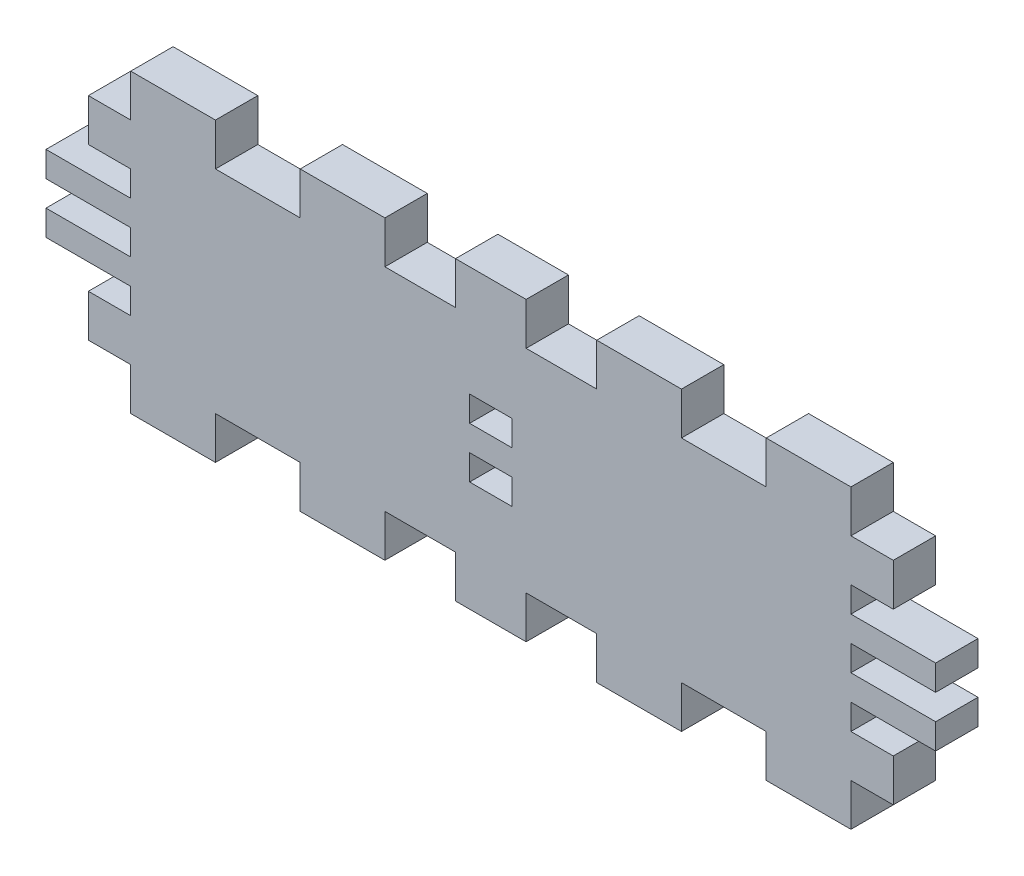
from build123d import *

# Parameters (mm, degrees)
SKETCH1_W           = 63
SKETCH1_H           = 21
BOSS_EXTRUDE1_DEPTH = 3
SKETCH2_W           = 3
SKETCH2_H           = 1.8
CUT_EXTRUDE1_DEPTH  = 10
SKETCH3_W           = 6
SKETCH3_H           = 1.8
CUT_EXTRUDE2_DEPTH  = 10
SKETCH4_W           = 6
SKETCH4_H           = 3
SKETCH4_W_2         = 5
CUT_EXTRUDE7_DEPTH  = 10


with BuildPart() as part:
    # Sketch1 → Boss-Extrude1 (new body)
    with BuildSketch(Plane.XY):
        Rectangle(SKETCH1_W, SKETCH1_H)
    extrude(amount=BOSS_EXTRUDE1_DEPTH)

    # Sketch2 → Cut-Extrude1 (cut)
    with BuildSketch(Plane(origin=(0, 0, 0), x_dir=(-1, 0, 0), z_dir=(0, 0, -1))):
        with Locations((0, 1.8)):
            Rectangle(SKETCH2_W, SKETCH2_H)
        with Locations((0, -1.8)):
            Rectangle(SKETCH2_W, SKETCH2_H)
    extrude(amount=-CUT_EXTRUDE1_DEPTH, mode=Mode.SUBTRACT)

    # Sketch3 → Cut-Extrude2 (cut)
    with BuildSketch(Plane(origin=(0, 0, 0), x_dir=(-1, 0, 0), z_dir=(0, 0, -1))):
        Polygon((-28.5, 2.7), (-31.5, 2.7), (-31.5, 7.5), (-28.5, 7.5), (-28.5, 4.5), (-25.5, 4.5), (-25.5, 2.7), align=None)
        with Locations((-28.5, 0)):
            Rectangle(SKETCH3_W, SKETCH3_H)
        Polygon((-28.5, -2.7), (-25.5, -2.7), (-25.5, -4.5), (-28.5, -4.5), (-28.5, -7.5), (-31.5, -7.5), (-31.5, -2.7), align=None)
        Polygon((28.5, -4.5), (25.5, -4.5), (25.5, -2.7), (28.5, -2.7), (31.5, -2.7), (31.5, -7.5), (28.5, -7.5), align=None)
        Polygon((28.5, 4.5), (28.5, 7.5), (31.5, 7.5), (31.5, 2.7), (28.5, 2.7), (25.5, 2.7), (25.5, 4.5), align=None)
        with Locations((28.5, 0)):
            Rectangle(SKETCH3_W, SKETCH3_H)
    extrude(amount=-CUT_EXTRUDE2_DEPTH, mode=Mode.SUBTRACT)

    # Sketch4 → Cut-Extrude7 (cut)
    with BuildSketch(Plane(origin=(0, 0, 0), x_dir=(-1, 0, 0), z_dir=(0, 0, -1))):
        with Locations((-28.5, 9)):
            Rectangle(SKETCH4_W, SKETCH4_H)
        with Locations((-16.5, 9)):
            Rectangle(SKETCH4_W, SKETCH4_H)
        with Locations((-5, 9)):
            Rectangle(SKETCH4_W_2, SKETCH4_H)
        with Locations((5, 9)):
            Rectangle(SKETCH4_W_2, SKETCH4_H)
        with Locations((16.5, 9)):
            Rectangle(SKETCH4_W, SKETCH4_H)
        with Locations((-28.5, -9)):
            Rectangle(SKETCH4_W, SKETCH4_H)
        with Locations((28.5, 9)):
            Rectangle(SKETCH4_W, SKETCH4_H)
        with Locations((28.5, -9)):
            Rectangle(SKETCH4_W, SKETCH4_H)
        with Locations((16.5, -9)):
            Rectangle(SKETCH4_W, SKETCH4_H)
        with Locations((5, -9)):
            Rectangle(SKETCH4_W_2, SKETCH4_H)
        with Locations((-5, -9)):
            Rectangle(SKETCH4_W_2, SKETCH4_H)
        with Locations((-16.5, -9)):
            Rectangle(SKETCH4_W, SKETCH4_H)
    extrude(amount=-CUT_EXTRUDE7_DEPTH, mode=Mode.SUBTRACT)


solid = part.part
